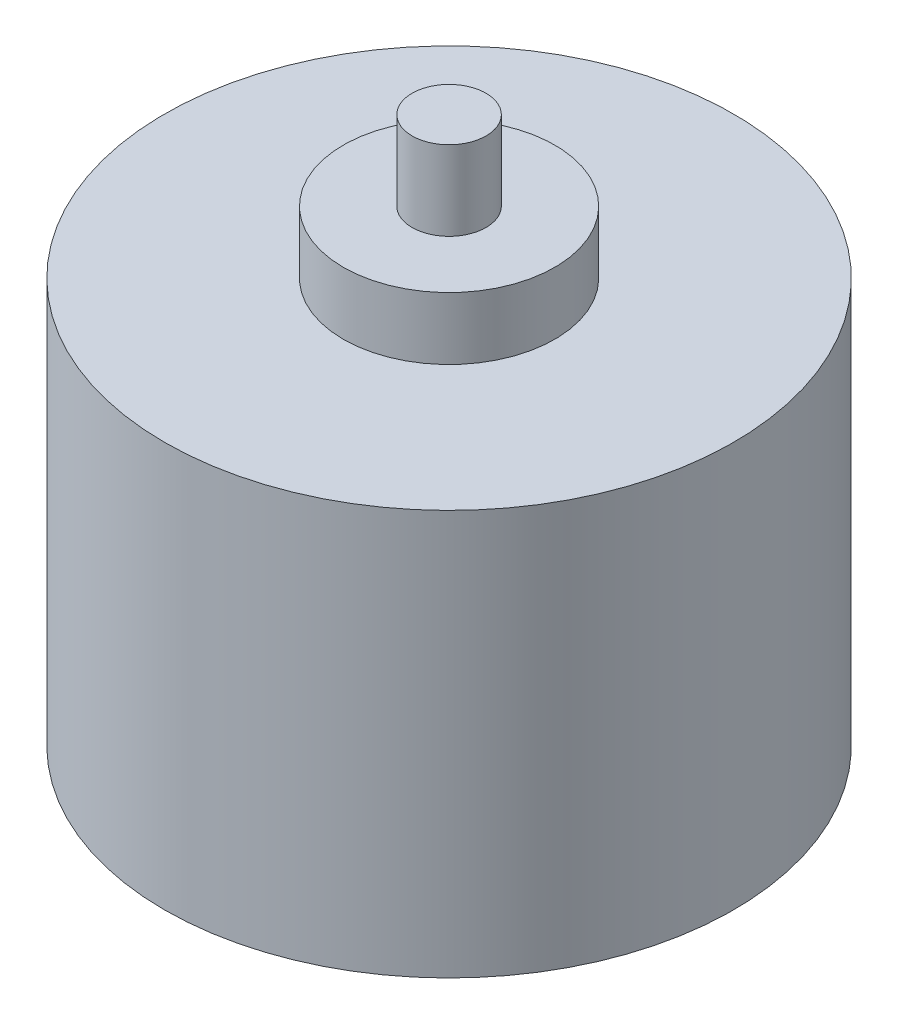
from build123d import *

# Parameters (mm, degrees)
SKETCH1_R      = 12.75
EXTRUDE1_DEPTH = 18.15
SKETCH2_R      = 1.65735
EXTRUDE2_DEPTH = 6.35
SKETCH4_R      = 4.74345
EXTRUDE4_DEPTH = 1.016
EXTRUDE5_START = 6.35
SKETCH5_R      = 1.65735
EXTRUDE5_DEPTH = 6.35
EXTRUDE6_START = 2.794
SKETCH6_R      = 4.74345
EXTRUDE6_DEPTH = 2.794


with BuildPart() as part:
    # Sketch1 → Extrude1 (new body)
    with BuildSketch(Plane(origin=(0, 0, 0), x_dir=(1, 0, 0), z_dir=(0, 1, 0))):
        with Locations(Location((0, 0, 0), (0, 0, 270))):
            Circle(SKETCH1_R)
    extrude(amount=EXTRUDE1_DEPTH)

    # Sketch2 → Extrude2 (add)
    with BuildSketch(Plane(origin=(0, 18.15, 0), x_dir=(-1, 0, 0), z_dir=(0, 1, 0))):
        with Locations(Location((0, 0, 0), (0, 0, 90))):
            Circle(SKETCH2_R)
    extrude(amount=EXTRUDE2_DEPTH)

    # Sketch4 → Extrude4 (add)
    with BuildSketch(Plane.XZ):
        with Locations(Location((0, 0, 0), (0, 0, 90))):
            Circle(SKETCH4_R)
    extrude(amount=EXTRUDE4_DEPTH)

    # Sketch5 → Extrude5 (add)
    with BuildSketch(Plane.XZ.offset(1.016).offset(EXTRUDE5_START)):
        with Locations(Location((0, 0, 0), (0, 0, 90))):
            Circle(SKETCH5_R)
    extrude(amount=-EXTRUDE5_DEPTH)

    # Sketch6 → Extrude6 (add)
    with BuildSketch(Plane(origin=(0, 18.15, 0), x_dir=(-1, 0, 0), z_dir=(0, 1, 0)).offset(EXTRUDE6_START)):
        with Locations(Location((0, 0, 0), (0, 0, 90))):
            Circle(SKETCH6_R)
    extrude(amount=-EXTRUDE6_DEPTH)


solid = part.part
